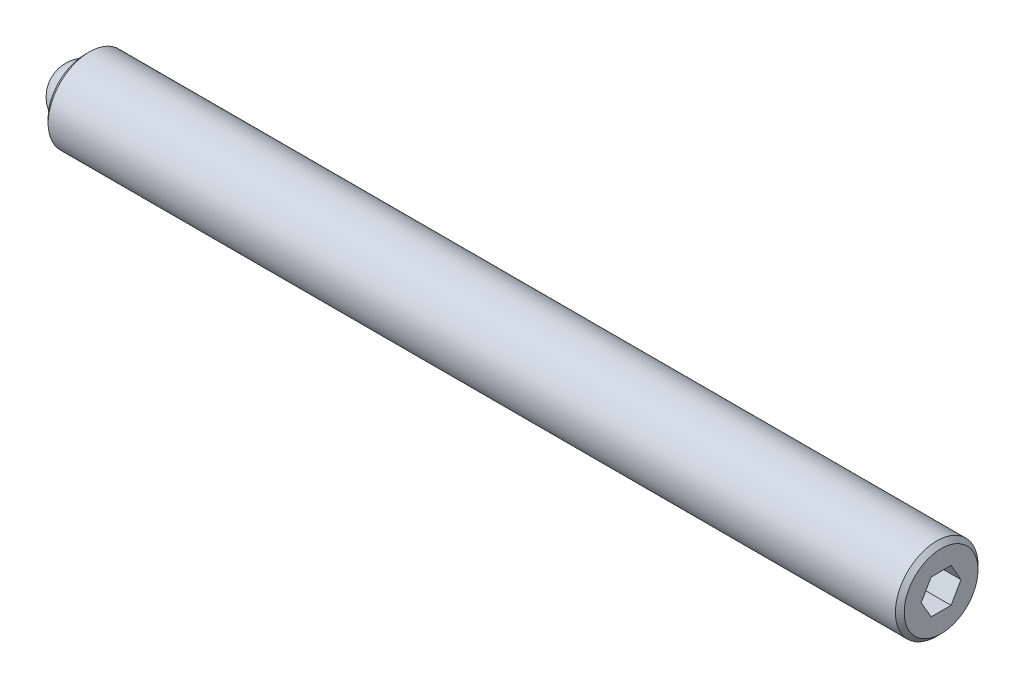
ISO-10303-21;
HEADER;
FILE_DESCRIPTION(('STEP AP214'),'2;1');
FILE_NAME('part.step','',(''),(''),'','','');
FILE_SCHEMA(('AUTOMOTIVE_DESIGN { 1 0 10303 214 1 1 1 1 }'));
ENDSEC;
DATA;
#1=APPLICATION_CONTEXT('core data for automotive mechanical design processes');
#2=APPLICATION_PROTOCOL_DEFINITION('international standard','automotive_design',2000,#1);
#3=PRODUCT_CONTEXT('',#1,'mechanical');
#4=PRODUCT('Part','Part','',(#3));
#5=PRODUCT_RELATED_PRODUCT_CATEGORY('part','',(#4));
#6=PRODUCT_DEFINITION_FORMATION('','',#4);
#7=PRODUCT_DEFINITION_CONTEXT('part definition',#1,'design');
#8=PRODUCT_DEFINITION('design','',#6,#7);
#9=PRODUCT_DEFINITION_SHAPE('','',#8);
#10=(LENGTH_UNIT() NAMED_UNIT(*) SI_UNIT(.MILLI.,.METRE.));
#11=(NAMED_UNIT(*) PLANE_ANGLE_UNIT() SI_UNIT($,.RADIAN.));
#12=(NAMED_UNIT(*) SI_UNIT($,.STERADIAN.) SOLID_ANGLE_UNIT());
#13=UNCERTAINTY_MEASURE_WITH_UNIT(LENGTH_MEASURE(1.E-05),#10,'distance_accuracy_value','');
#14=(GEOMETRIC_REPRESENTATION_CONTEXT(3) GLOBAL_UNCERTAINTY_ASSIGNED_CONTEXT((#13)) GLOBAL_UNIT_ASSIGNED_CONTEXT((#10,
#11,#12)) REPRESENTATION_CONTEXT('',''));
#15=CARTESIAN_POINT('',(0.,0.,0.));
#16=DIRECTION('',(0.,0.,1.));
#17=DIRECTION('',(1.,0.,0.));
#18=AXIS2_PLACEMENT_3D('',#15,#16,#17);
#19=CARTESIAN_POINT('',(0.,0.,0.));
#20=DIRECTION('',(0.,-1.,0.));
#21=DIRECTION('',(0.,0.,1.));
#22=AXIS2_PLACEMENT_3D('',#19,#20,#21);
#23=SPHERICAL_SURFACE('',#22,1.5875);
#24=CARTESIAN_POINT('',(0.,-1.5875,0.));
#25=VERTEX_POINT('',#24);
#26=VERTEX_LOOP('',#25);
#27=FACE_BOUND('',#26,.T.);
#28=ADVANCED_FACE('F43',(#27),#23,.T.);
#29=CLOSED_SHELL('',(#28));
#30=MANIFOLD_SOLID_BREP('B2',#29);
#31=CARTESIAN_POINT('',(49.2125,0.,0.));
#32=DIRECTION('',(-1.,0.,0.));
#33=DIRECTION('',(0.,0.,1.));
#34=AXIS2_PLACEMENT_3D('',#31,#32,#33);
#35=CYLINDRICAL_SURFACE('',#34,2.3749);
#36=CARTESIAN_POINT('',(48.9585,0.,0.));
#37=DIRECTION('',(1.,0.,0.));
#38=DIRECTION('',(0.,0.,-1.));
#39=AXIS2_PLACEMENT_3D('',#36,#37,#38);
#40=CIRCLE('',#39,2.3749);
#41=CARTESIAN_POINT('',(48.9585,0.,-2.3749));
#42=VERTEX_POINT('',#41);
#43=EDGE_CURVE('E41',#42,#42,#40,.F.);
#44=ORIENTED_EDGE('',*,*,#43,.T.);
#45=EDGE_LOOP('',(#44));
#46=FACE_BOUND('',#45,.T.);
#47=CARTESIAN_POINT('',(0.254000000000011,0.,0.));
#48=DIRECTION('',(1.,0.,0.));
#49=DIRECTION('',(0.,0.,-1.));
#50=AXIS2_PLACEMENT_3D('',#47,#48,#49);
#51=CIRCLE('',#50,2.3749);
#52=CARTESIAN_POINT('',(0.254000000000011,0.,-2.3749));
#53=VERTEX_POINT('',#52);
#54=EDGE_CURVE('E177',#53,#53,#51,.T.);
#55=ORIENTED_EDGE('',*,*,#54,.T.);
#56=EDGE_LOOP('',(#55));
#57=FACE_BOUND('',#56,.T.);
#58=ADVANCED_FACE('F56',(#46,#57),#35,.T.);
#59=CARTESIAN_POINT('',(49.2125,0.,0.));
#60=DIRECTION('',(1.,0.,0.));
#61=DIRECTION('',(0.,0.,-1.));
#62=AXIS2_PLACEMENT_3D('',#59,#60,#61);
#63=PLANE('',#62);
#64=DIRECTION('',(0.,0.866025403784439,-0.5));
#65=VECTOR('',#64,1.);
#66=CARTESIAN_POINT('',(49.2125,-0.992187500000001,-0.572839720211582));
#67=LINE('',#66,#65);
#68=CARTESIAN_POINT('',(49.2125,-0.992187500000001,-0.572839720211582));
#69=VERTEX_POINT('',#68);
#70=CARTESIAN_POINT('',(49.2125,0.,-1.14567944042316));
#71=VERTEX_POINT('',#70);
#72=EDGE_CURVE('E78',#69,#71,#67,.T.);
#73=ORIENTED_EDGE('',*,*,#72,.F.);
#74=DIRECTION('',(0.,0.,-1.));
#75=VECTOR('',#74,1.);
#76=CARTESIAN_POINT('',(49.2125,-0.992187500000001,0.572839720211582));
#77=LINE('',#76,#75);
#78=CARTESIAN_POINT('',(49.2125,-0.992187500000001,0.572839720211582));
#79=VERTEX_POINT('',#78);
#80=EDGE_CURVE('E146',#79,#69,#77,.T.);
#81=ORIENTED_EDGE('',*,*,#80,.F.);
#82=DIRECTION('',(0.,-0.866025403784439,-0.5));
#83=VECTOR('',#82,1.);
#84=CARTESIAN_POINT('',(49.2125,0.,1.14567944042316));
#85=LINE('',#84,#83);
#86=CARTESIAN_POINT('',(49.2125,0.,1.14567944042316));
#87=VERTEX_POINT('',#86);
#88=EDGE_CURVE('E170',#87,#79,#85,.T.);
#89=ORIENTED_EDGE('',*,*,#88,.F.);
#90=DIRECTION('',(0.,-0.866025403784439,0.5));
#91=VECTOR('',#90,1.);
#92=CARTESIAN_POINT('',(49.2125,0.992187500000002,0.572839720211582));
#93=LINE('',#92,#91);
#94=CARTESIAN_POINT('',(49.2125,0.992187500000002,0.572839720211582));
#95=VERTEX_POINT('',#94);
#96=EDGE_CURVE('E167',#95,#87,#93,.T.);
#97=ORIENTED_EDGE('',*,*,#96,.F.);
#98=DIRECTION('',(0.,0.,1.));
#99=VECTOR('',#98,1.);
#100=CARTESIAN_POINT('',(49.2125,0.992187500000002,-0.572839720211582));
#101=LINE('',#100,#99);
#102=CARTESIAN_POINT('',(49.2125,0.992187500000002,-0.572839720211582));
#103=VERTEX_POINT('',#102);
#104=EDGE_CURVE('E164',#103,#95,#101,.T.);
#105=ORIENTED_EDGE('',*,*,#104,.F.);
#106=DIRECTION('',(0.,0.866025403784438,0.5));
#107=VECTOR('',#106,1.);
#108=CARTESIAN_POINT('',(49.2125,0.,-1.14567944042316));
#109=LINE('',#108,#107);
#110=EDGE_CURVE('E137',#71,#103,#109,.T.);
#111=ORIENTED_EDGE('',*,*,#110,.F.);
#112=EDGE_LOOP('',(#73,#81,#89,#97,#105,#111));
#113=FACE_BOUND('',#112,.T.);
#114=CARTESIAN_POINT('',(49.2125,0.,0.));
#115=DIRECTION('',(1.,0.,0.));
#116=DIRECTION('',(0.,0.,-1.));
#117=AXIS2_PLACEMENT_3D('',#114,#115,#116);
#118=CIRCLE('',#117,2.12090000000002);
#119=CARTESIAN_POINT('',(49.2125,0.,-2.12090000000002));
#120=VERTEX_POINT('',#119);
#121=EDGE_CURVE('E64',#120,#120,#118,.T.);
#122=ORIENTED_EDGE('',*,*,#121,.T.);
#123=EDGE_LOOP('',(#122));
#124=FACE_BOUND('',#123,.T.);
#125=ADVANCED_FACE('F194',(#113,#124),#63,.T.);
#126=CARTESIAN_POINT('',(0.,0.,0.));
#127=DIRECTION('',(1.,0.,0.));
#128=DIRECTION('',(0.,0.,-1.));
#129=AXIS2_PLACEMENT_3D('',#126,#127,#128);
#130=PLANE('',#129);
#131=CARTESIAN_POINT('',(0.,0.,0.));
#132=DIRECTION('',(-1.,0.,0.));
#133=DIRECTION('',(0.,0.,1.));
#134=AXIS2_PLACEMENT_3D('',#131,#132,#133);
#135=CIRCLE('',#134,1.5875);
#136=CARTESIAN_POINT('',(0.,1.58623,-0.0634872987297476));
#137=VERTEX_POINT('',#136);
#138=CARTESIAN_POINT('',(0.,1.58623,0.0634872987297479));
#139=VERTEX_POINT('',#138);
#140=EDGE_CURVE('E133',#137,#139,#135,.T.);
#141=ORIENTED_EDGE('',*,*,#140,.F.);
#142=CARTESIAN_POINT('',(0.,1.5875,0.));
#143=DIRECTION('',(-1.,0.,0.));
#144=DIRECTION('',(0.,0.,1.));
#145=AXIS2_PLACEMENT_3D('',#142,#143,#144);
#146=CIRCLE('',#145,0.0635000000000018);
#147=EDGE_CURVE('E126',#139,#137,#146,.T.);
#148=ORIENTED_EDGE('',*,*,#147,.F.);
#149=EDGE_LOOP('',(#141,#148));
#150=FACE_BOUND('',#149,.T.);
#151=CARTESIAN_POINT('',(0.,0.,0.));
#152=DIRECTION('',(1.,0.,0.));
#153=DIRECTION('',(0.,0.,-1.));
#154=AXIS2_PLACEMENT_3D('',#151,#152,#153);
#155=CIRCLE('',#154,2.12089999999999);
#156=CARTESIAN_POINT('',(0.,0.,-2.12089999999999));
#157=VERTEX_POINT('',#156);
#158=EDGE_CURVE('E189',#157,#157,#155,.F.);
#159=ORIENTED_EDGE('',*,*,#158,.T.);
#160=EDGE_LOOP('',(#159));
#161=FACE_BOUND('',#160,.T.);
#162=ADVANCED_FACE('F206',(#150,#161),#130,.F.);
#163=CARTESIAN_POINT('',(0.254000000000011,0.,0.));
#164=DIRECTION('',(1.,0.,0.));
#165=DIRECTION('',(0.,0.,-1.));
#166=AXIS2_PLACEMENT_3D('',#163,#164,#165);
#167=CONICAL_SURFACE('',#166,2.3749,0.785398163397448);
#168=ORIENTED_EDGE('',*,*,#158,.F.);
#169=EDGE_LOOP('',(#168));
#170=FACE_BOUND('',#169,.T.);
#171=ORIENTED_EDGE('',*,*,#54,.F.);
#172=EDGE_LOOP('',(#171));
#173=FACE_BOUND('',#172,.T.);
#174=ADVANCED_FACE('F198',(#170,#173),#167,.T.);
#175=CARTESIAN_POINT('',(49.2125,0.,0.));
#176=DIRECTION('',(-1.,0.,0.));
#177=DIRECTION('',(0.,0.,1.));
#178=AXIS2_PLACEMENT_3D('',#175,#176,#177);
#179=CONICAL_SURFACE('',#178,2.12090000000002,0.785398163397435);
#180=ORIENTED_EDGE('',*,*,#43,.F.);
#181=EDGE_LOOP('',(#180));
#182=FACE_BOUND('',#181,.T.);
#183=ORIENTED_EDGE('',*,*,#121,.F.);
#184=EDGE_LOOP('',(#183));
#185=FACE_BOUND('',#184,.T.);
#186=ADVANCED_FACE('F58',(#182,#185),#179,.T.);
#187=CARTESIAN_POINT('',(46.9265,-0.992187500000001,-0.572839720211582));
#188=DIRECTION('',(0.,-0.5,-0.866025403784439));
#189=DIRECTION('',(0.,0.866025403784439,-0.5));
#190=AXIS2_PLACEMENT_3D('',#187,#188,#189);
#191=PLANE('',#190);
#192=ORIENTED_EDGE('',*,*,#72,.T.);
#193=DIRECTION('',(1.,0.,0.));
#194=VECTOR('',#193,1.);
#195=CARTESIAN_POINT('',(46.9265,0.,-1.14567944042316));
#196=LINE('',#195,#194);
#197=CARTESIAN_POINT('',(46.9265,0.,-1.14567944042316));
#198=VERTEX_POINT('',#197);
#199=EDGE_CURVE('E160',#198,#71,#196,.T.);
#200=ORIENTED_EDGE('',*,*,#199,.F.);
#201=DIRECTION('',(0.,0.866025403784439,-0.5));
#202=VECTOR('',#201,1.);
#203=CARTESIAN_POINT('',(46.9265,-0.992187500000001,-0.572839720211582));
#204=LINE('',#203,#202);
#205=CARTESIAN_POINT('',(46.9265,-0.992187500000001,-0.572839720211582));
#206=VERTEX_POINT('',#205);
#207=EDGE_CURVE('E142',#206,#198,#204,.T.);
#208=ORIENTED_EDGE('',*,*,#207,.F.);
#209=DIRECTION('',(1.,0.,0.));
#210=VECTOR('',#209,1.);
#211=CARTESIAN_POINT('',(46.9265,-0.992187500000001,-0.572839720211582));
#212=LINE('',#211,#210);
#213=EDGE_CURVE('E175',#206,#69,#212,.T.);
#214=ORIENTED_EDGE('',*,*,#213,.T.);
#215=EDGE_LOOP('',(#192,#200,#208,#214));
#216=FACE_BOUND('',#215,.T.);
#217=ADVANCED_FACE('F197',(#216),#191,.F.);
#218=CARTESIAN_POINT('',(46.9265,-0.992187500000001,0.572839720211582));
#219=DIRECTION('',(0.,-1.,0.));
#220=DIRECTION('',(0.,0.,-1.));
#221=AXIS2_PLACEMENT_3D('',#218,#219,#220);
#222=PLANE('',#221);
#223=ORIENTED_EDGE('',*,*,#80,.T.);
#224=ORIENTED_EDGE('',*,*,#213,.F.);
#225=DIRECTION('',(0.,0.,-1.));
#226=VECTOR('',#225,1.);
#227=CARTESIAN_POINT('',(46.9265,-0.992187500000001,0.572839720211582));
#228=LINE('',#227,#226);
#229=CARTESIAN_POINT('',(46.9265,-0.992187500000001,0.572839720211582));
#230=VERTEX_POINT('',#229);
#231=EDGE_CURVE('E158',#230,#206,#228,.T.);
#232=ORIENTED_EDGE('',*,*,#231,.F.);
#233=DIRECTION('',(1.,0.,0.));
#234=VECTOR('',#233,1.);
#235=CARTESIAN_POINT('',(46.9265,-0.992187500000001,0.572839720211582));
#236=LINE('',#235,#234);
#237=EDGE_CURVE('E178',#230,#79,#236,.T.);
#238=ORIENTED_EDGE('',*,*,#237,.T.);
#239=EDGE_LOOP('',(#223,#224,#232,#238));
#240=FACE_BOUND('',#239,.T.);
#241=ADVANCED_FACE('F204',(#240),#222,.F.);
#242=CARTESIAN_POINT('',(46.9265,0.,1.14567944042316));
#243=DIRECTION('',(0.,-0.5,0.866025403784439));
#244=DIRECTION('',(0.,-0.866025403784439,-0.5));
#245=AXIS2_PLACEMENT_3D('',#242,#243,#244);
#246=PLANE('',#245);
#247=ORIENTED_EDGE('',*,*,#88,.T.);
#248=ORIENTED_EDGE('',*,*,#237,.F.);
#249=DIRECTION('',(0.,-0.866025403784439,-0.5));
#250=VECTOR('',#249,1.);
#251=CARTESIAN_POINT('',(46.9265,0.,1.14567944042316));
#252=LINE('',#251,#250);
#253=CARTESIAN_POINT('',(46.9265,0.,1.14567944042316));
#254=VERTEX_POINT('',#253);
#255=EDGE_CURVE('E155',#254,#230,#252,.T.);
#256=ORIENTED_EDGE('',*,*,#255,.F.);
#257=DIRECTION('',(1.,0.,0.));
#258=VECTOR('',#257,1.);
#259=CARTESIAN_POINT('',(46.9265,0.,1.14567944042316));
#260=LINE('',#259,#258);
#261=EDGE_CURVE('E180',#254,#87,#260,.T.);
#262=ORIENTED_EDGE('',*,*,#261,.T.);
#263=EDGE_LOOP('',(#247,#248,#256,#262));
#264=FACE_BOUND('',#263,.T.);
#265=ADVANCED_FACE('F234',(#264),#246,.F.);
#266=CARTESIAN_POINT('',(46.9265,0.992187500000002,0.572839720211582));
#267=DIRECTION('',(0.,0.5,0.866025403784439));
#268=DIRECTION('',(0.,-0.866025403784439,0.5));
#269=AXIS2_PLACEMENT_3D('',#266,#267,#268);
#270=PLANE('',#269);
#271=ORIENTED_EDGE('',*,*,#96,.T.);
#272=ORIENTED_EDGE('',*,*,#261,.F.);
#273=DIRECTION('',(0.,-0.866025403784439,0.5));
#274=VECTOR('',#273,1.);
#275=CARTESIAN_POINT('',(46.9265,0.992187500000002,0.572839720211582));
#276=LINE('',#275,#274);
#277=CARTESIAN_POINT('',(46.9265,0.992187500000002,0.572839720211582));
#278=VERTEX_POINT('',#277);
#279=EDGE_CURVE('E152',#278,#254,#276,.T.);
#280=ORIENTED_EDGE('',*,*,#279,.F.);
#281=DIRECTION('',(1.,0.,0.));
#282=VECTOR('',#281,1.);
#283=CARTESIAN_POINT('',(46.9265,0.992187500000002,0.572839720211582));
#284=LINE('',#283,#282);
#285=EDGE_CURVE('E182',#278,#95,#284,.T.);
#286=ORIENTED_EDGE('',*,*,#285,.T.);
#287=EDGE_LOOP('',(#271,#272,#280,#286));
#288=FACE_BOUND('',#287,.T.);
#289=ADVANCED_FACE('F230',(#288),#270,.F.);
#290=CARTESIAN_POINT('',(46.9265,0.992187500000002,-0.572839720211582));
#291=DIRECTION('',(0.,1.,0.));
#292=DIRECTION('',(0.,0.,1.));
#293=AXIS2_PLACEMENT_3D('',#290,#291,#292);
#294=PLANE('',#293);
#295=ORIENTED_EDGE('',*,*,#104,.T.);
#296=ORIENTED_EDGE('',*,*,#285,.F.);
#297=DIRECTION('',(0.,0.,1.));
#298=VECTOR('',#297,1.);
#299=CARTESIAN_POINT('',(46.9265,0.992187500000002,-0.572839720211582));
#300=LINE('',#299,#298);
#301=CARTESIAN_POINT('',(46.9265,0.992187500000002,-0.572839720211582));
#302=VERTEX_POINT('',#301);
#303=EDGE_CURVE('E149',#302,#278,#300,.T.);
#304=ORIENTED_EDGE('',*,*,#303,.F.);
#305=DIRECTION('',(1.,0.,0.));
#306=VECTOR('',#305,1.);
#307=CARTESIAN_POINT('',(46.9265,0.992187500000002,-0.572839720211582));
#308=LINE('',#307,#306);
#309=EDGE_CURVE('E184',#302,#103,#308,.T.);
#310=ORIENTED_EDGE('',*,*,#309,.T.);
#311=EDGE_LOOP('',(#295,#296,#304,#310));
#312=FACE_BOUND('',#311,.T.);
#313=ADVANCED_FACE('F226',(#312),#294,.F.);
#314=CARTESIAN_POINT('',(46.9265,0.,-1.14567944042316));
#315=DIRECTION('',(0.,0.5,-0.866025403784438));
#316=DIRECTION('',(0.,0.866025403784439,0.5));
#317=AXIS2_PLACEMENT_3D('',#314,#315,#316);
#318=PLANE('',#317);
#319=ORIENTED_EDGE('',*,*,#110,.T.);
#320=ORIENTED_EDGE('',*,*,#309,.F.);
#321=DIRECTION('',(0.,0.866025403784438,0.5));
#322=VECTOR('',#321,1.);
#323=CARTESIAN_POINT('',(46.9265,0.,-1.14567944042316));
#324=LINE('',#323,#322);
#325=EDGE_CURVE('E145',#198,#302,#324,.T.);
#326=ORIENTED_EDGE('',*,*,#325,.F.);
#327=ORIENTED_EDGE('',*,*,#199,.T.);
#328=EDGE_LOOP('',(#319,#320,#326,#327));
#329=FACE_BOUND('',#328,.T.);
#330=ADVANCED_FACE('F222',(#329),#318,.F.);
#331=CARTESIAN_POINT('',(46.9265,0.,0.));
#332=DIRECTION('',(1.,0.,0.));
#333=DIRECTION('',(0.,0.,-1.));
#334=AXIS2_PLACEMENT_3D('',#331,#332,#333);
#335=PLANE('',#334);
#336=ORIENTED_EDGE('',*,*,#207,.T.);
#337=ORIENTED_EDGE('',*,*,#325,.T.);
#338=ORIENTED_EDGE('',*,*,#303,.T.);
#339=ORIENTED_EDGE('',*,*,#279,.T.);
#340=ORIENTED_EDGE('',*,*,#255,.T.);
#341=ORIENTED_EDGE('',*,*,#231,.T.);
#342=EDGE_LOOP('',(#336,#337,#338,#339,#340,#341));
#343=FACE_BOUND('',#342,.T.);
#344=ADVANCED_FACE('F225',(#343),#335,.T.);
#345=CARTESIAN_POINT('',(1.5875,0.,0.));
#346=DIRECTION('',(-1.,0.,0.));
#347=DIRECTION('',(0.,0.,1.));
#348=AXIS2_PLACEMENT_3D('',#345,#346,#347);
#349=CYLINDRICAL_SURFACE('',#348,1.5875);
#350=CARTESIAN_POINT('',(1.5875,0.,0.));
#351=DIRECTION('',(-1.,0.,0.));
#352=DIRECTION('',(0.,0.,1.));
#353=AXIS2_PLACEMENT_3D('',#350,#351,#352);
#354=CIRCLE('',#353,1.5875);
#355=CARTESIAN_POINT('',(1.5875,1.58623,-0.0634872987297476));
#356=VERTEX_POINT('',#355);
#357=CARTESIAN_POINT('',(1.5875,1.58623,0.0634872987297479));
#358=VERTEX_POINT('',#357);
#359=EDGE_CURVE('E131',#356,#358,#354,.T.);
#360=ORIENTED_EDGE('',*,*,#359,.F.);
#361=DIRECTION('',(-1.,0.,0.));
#362=VECTOR('',#361,1.);
#363=CARTESIAN_POINT('',(1.5875,1.58623,-0.0634872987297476));
#364=LINE('',#363,#362);
#365=EDGE_CURVE('E124',#356,#137,#364,.T.);
#366=ORIENTED_EDGE('',*,*,#365,.T.);
#367=ORIENTED_EDGE('',*,*,#140,.T.);
#368=DIRECTION('',(-1.,0.,0.));
#369=VECTOR('',#368,1.);
#370=CARTESIAN_POINT('',(1.5875,1.58623,0.0634872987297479));
#371=LINE('',#370,#369);
#372=EDGE_CURVE('E121',#358,#139,#371,.T.);
#373=ORIENTED_EDGE('',*,*,#372,.F.);
#374=EDGE_LOOP('',(#360,#366,#367,#373));
#375=FACE_BOUND('',#374,.T.);
#376=ADVANCED_FACE('F130',(#375),#349,.F.);
#377=CARTESIAN_POINT('',(1.5875,0.,0.));
#378=DIRECTION('',(-1.,0.,0.));
#379=DIRECTION('',(0.,0.,1.));
#380=AXIS2_PLACEMENT_3D('',#377,#378,#379);
#381=PLANE('',#380);
#382=ORIENTED_EDGE('',*,*,#359,.T.);
#383=CARTESIAN_POINT('',(1.5875,1.5875,0.));
#384=DIRECTION('',(-1.,0.,0.));
#385=DIRECTION('',(0.,0.,1.));
#386=AXIS2_PLACEMENT_3D('',#383,#384,#385);
#387=CIRCLE('',#386,0.0635000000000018);
#388=EDGE_CURVE('E70',#358,#356,#387,.T.);
#389=ORIENTED_EDGE('',*,*,#388,.T.);
#390=EDGE_LOOP('',(#382,#389));
#391=FACE_BOUND('',#390,.T.);
#392=ADVANCED_FACE('F135',(#391),#381,.T.);
#393=CARTESIAN_POINT('',(1.5875,1.5875,0.));
#394=DIRECTION('',(-1.,0.,0.));
#395=DIRECTION('',(0.,0.,1.));
#396=AXIS2_PLACEMENT_3D('',#393,#394,#395);
#397=CYLINDRICAL_SURFACE('',#396,0.0635000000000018);
#398=ORIENTED_EDGE('',*,*,#147,.T.);
#399=ORIENTED_EDGE('',*,*,#365,.F.);
#400=ORIENTED_EDGE('',*,*,#388,.F.);
#401=ORIENTED_EDGE('',*,*,#372,.T.);
#402=EDGE_LOOP('',(#398,#399,#400,#401));
#403=FACE_BOUND('',#402,.T.);
#404=ADVANCED_FACE('F120',(#403),#397,.F.);
#405=CLOSED_SHELL('',(#58,#125,#162,#174,#186,#217,#241,#265,#289,#313,#330,#344,#376,#392,#404));
#406=MANIFOLD_SOLID_BREP('B6',#405);
#407=ADVANCED_BREP_SHAPE_REPRESENTATION('',(#18,#30,#406),#14);
#408=SHAPE_DEFINITION_REPRESENTATION(#9,#407);
ENDSEC;
END-ISO-10303-21;
